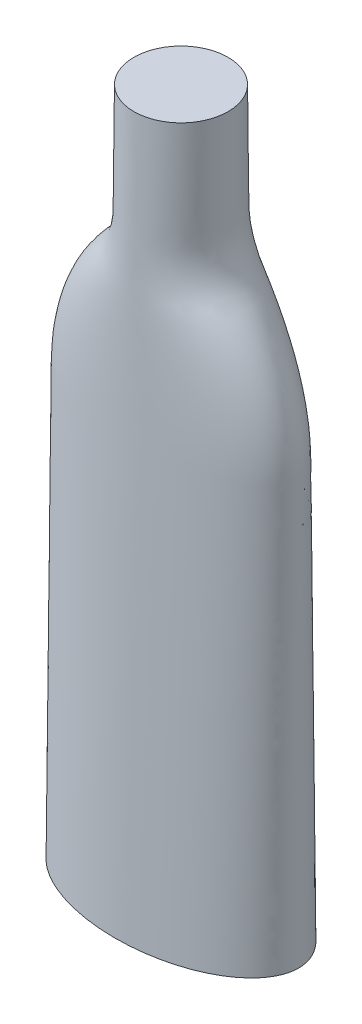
ISO-10303-21;
HEADER;
FILE_DESCRIPTION(('STEP AP214'),'2;1');
FILE_NAME('part.step','',(''),(''),'','','');
FILE_SCHEMA(('AUTOMOTIVE_DESIGN { 1 0 10303 214 1 1 1 1 }'));
ENDSEC;
DATA;
#1=APPLICATION_CONTEXT('core data for automotive mechanical design processes');
#2=APPLICATION_PROTOCOL_DEFINITION('international standard','automotive_design',2000,#1);
#3=PRODUCT_CONTEXT('',#1,'mechanical');
#4=PRODUCT('Part','Part','',(#3));
#5=PRODUCT_RELATED_PRODUCT_CATEGORY('part','',(#4));
#6=PRODUCT_DEFINITION_FORMATION('','',#4);
#7=PRODUCT_DEFINITION_CONTEXT('part definition',#1,'design');
#8=PRODUCT_DEFINITION('design','',#6,#7);
#9=PRODUCT_DEFINITION_SHAPE('','',#8);
#10=(LENGTH_UNIT() NAMED_UNIT(*) SI_UNIT(.MILLI.,.METRE.));
#11=(NAMED_UNIT(*) PLANE_ANGLE_UNIT() SI_UNIT($,.RADIAN.));
#12=(NAMED_UNIT(*) SI_UNIT($,.STERADIAN.) SOLID_ANGLE_UNIT());
#13=UNCERTAINTY_MEASURE_WITH_UNIT(LENGTH_MEASURE(1.E-05),#10,'distance_accuracy_value','');
#14=(GEOMETRIC_REPRESENTATION_CONTEXT(3) GLOBAL_UNCERTAINTY_ASSIGNED_CONTEXT((#13)) GLOBAL_UNIT_ASSIGNED_CONTEXT((#10,
#11,#12)) REPRESENTATION_CONTEXT('',''));
#15=CARTESIAN_POINT('',(0.,0.,0.));
#16=DIRECTION('',(0.,0.,1.));
#17=DIRECTION('',(1.,0.,0.));
#18=AXIS2_PLACEMENT_3D('',#15,#16,#17);
#19=CARTESIAN_POINT('',(0.,150.,0.));
#20=DIRECTION('',(0.,1.,0.));
#21=DIRECTION('',(0.,0.,1.));
#22=AXIS2_PLACEMENT_3D('',#19,#20,#21);
#23=PLANE('',#22);
#24=CARTESIAN_POINT('',(0.,150.,0.));
#25=DIRECTION('',(0.,1.,0.));
#26=DIRECTION('',(0.,0.,1.));
#27=AXIS2_PLACEMENT_3D('',#24,#25,#26);
#28=CIRCLE('',#27,10.);
#29=CARTESIAN_POINT('',(0.,150.,10.));
#30=VERTEX_POINT('',#29);
#31=EDGE_CURVE('E120',#30,#30,#28,.T.);
#32=ORIENTED_EDGE('',*,*,#31,.T.);
#33=EDGE_LOOP('',(#32));
#34=FACE_BOUND('',#33,.T.);
#35=ADVANCED_FACE('F111',(#34),#23,.T.);
#36=CARTESIAN_POINT('',(0.,0.,0.));
#37=DIRECTION('',(0.,1.,0.));
#38=DIRECTION('',(0.,0.,1.));
#39=AXIS2_PLACEMENT_3D('',#36,#37,#38);
#40=PLANE('',#39);
#41=CARTESIAN_POINT('',(0.,0.,0.));
#42=DIRECTION('',(0.,1.,0.));
#43=DIRECTION('',(1.,0.,0.));
#44=AXIS2_PLACEMENT_3D('',#41,#42,#43);
#45=ELLIPSE('',#44,25.,14.);
#46=CARTESIAN_POINT('',(25.,0.,0.));
#47=VERTEX_POINT('',#46);
#48=EDGE_CURVE('E12',#47,#47,#45,.T.);
#49=ORIENTED_EDGE('',*,*,#48,.F.);
#50=EDGE_LOOP('',(#49));
#51=FACE_BOUND('',#50,.T.);
#52=ADVANCED_FACE('F113',(#51),#40,.F.);
#53=CARTESIAN_POINT('',(25.,0.,0.));
#54=CARTESIAN_POINT('',(25.,30.,0.));
#55=CARTESIAN_POINT('',(25.,60.0000000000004,0.));
#56=CARTESIAN_POINT('',(25.,100.207742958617,0.));
#57=CARTESIAN_POINT('',(21.0969790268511,110.030130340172,0.));
#58=CARTESIAN_POINT('',(11.4636328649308,120.237873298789,0.));
#59=CARTESIAN_POINT('',(10.,123.921268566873,0.));
#60=CARTESIAN_POINT('',(10.,135.166114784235,0.));
#61=CARTESIAN_POINT('',(10.,142.583057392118,0.));
#62=CARTESIAN_POINT('',(10.,150.,0.));
#63=CARTESIAN_POINT('',(25.,0.,-0.650891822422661));
#64=CARTESIAN_POINT('',(25.,30.,-0.587990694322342));
#65=CARTESIAN_POINT('',(25.,60.0000000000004,-0.525089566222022));
#66=CARTESIAN_POINT('',(25.,100.207742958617,-0.440785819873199));
#67=CARTESIAN_POINT('',(21.0969790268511,110.030130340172,-0.419383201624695));
#68=CARTESIAN_POINT('',(11.4636328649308,120.237873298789,-0.389954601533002));
#69=CARTESIAN_POINT('',(10.,123.921268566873,-0.381928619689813));
#70=CARTESIAN_POINT('',(10.,135.166114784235,-0.358351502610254));
#71=CARTESIAN_POINT('',(10.,142.583057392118,-0.342800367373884));
#72=CARTESIAN_POINT('',(10.,150.,-0.327249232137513));
#73=CARTESIAN_POINT('',(24.8355000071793,0.,-1.95224145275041));
#74=CARTESIAN_POINT('',(24.8497661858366,30.,-1.76361666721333));
#75=CARTESIAN_POINT('',(24.8640323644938,60.0000000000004,-1.57499188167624));
#76=CARTESIAN_POINT('',(24.8831527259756,100.207742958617,-1.3221859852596));
#77=CARTESIAN_POINT('',(21.0002321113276,110.030130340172,-1.25800487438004));
#78=CARTESIAN_POINT('',(11.4111907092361,120.237873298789,-1.16975584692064));
#79=CARTESIAN_POINT('',(9.95509547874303,123.921268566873,-1.1456879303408));
#80=CARTESIAN_POINT('',(9.96044284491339,135.166114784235,-1.07498604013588));
#81=CARTESIAN_POINT('',(9.96396989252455,142.583057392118,-1.02835206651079));
#82=CARTESIAN_POINT('',(9.96749694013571,150.,-0.981718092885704));
#83=CARTESIAN_POINT('',(24.139672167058,0.,-3.78957680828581));
#84=CARTESIAN_POINT('',(24.2119885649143,30.,-3.43282983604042));
#85=CARTESIAN_POINT('',(24.2843049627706,60.0000000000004,-3.07608286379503));
#86=CARTESIAN_POINT('',(24.3812276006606,100.207742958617,-2.59794984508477));
#87=CARTESIAN_POINT('',(20.583808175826,110.030130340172,-2.47656379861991));
#88=CARTESIAN_POINT('',(11.1842063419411,120.237873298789,-2.30965798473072));
#89=CARTESIAN_POINT('',(9.76017405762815,123.921268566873,-2.26413821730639));
#90=CARTESIAN_POINT('',(9.78728028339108,135.166114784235,-2.13041938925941));
#91=CARTESIAN_POINT('',(9.80515916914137,142.583057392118,-2.04222032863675));
#92=CARTESIAN_POINT('',(9.82303805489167,150.,-1.95402126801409));
#93=CARTESIAN_POINT('',(23.0951975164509,0.,-5.44860237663));
#94=CARTESIAN_POINT('',(23.2451819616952,30.,-4.95475174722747));
#95=CARTESIAN_POINT('',(23.3951664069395,60.0000000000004,-4.46090111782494));
#96=CARTESIAN_POINT('',(23.5961842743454,100.207742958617,-3.79901381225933));
#97=CARTESIAN_POINT('',(19.9309623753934,110.030130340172,-3.63097713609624));
#98=CARTESIAN_POINT('',(10.8287578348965,120.237873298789,-3.39992670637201));
#99=CARTESIAN_POINT('',(9.4542996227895,123.921268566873,-3.33691295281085));
#100=CARTESIAN_POINT('',(9.51051802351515,135.166114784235,-3.15180380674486));
#101=CARTESIAN_POINT('',(9.54759889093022,142.583057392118,-3.02970841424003));
#102=CARTESIAN_POINT('',(9.58467975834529,150.,-2.90761302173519));
#103=CARTESIAN_POINT('',(21.7980768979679,0.,-6.91516804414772));
#104=CARTESIAN_POINT('',(22.0291751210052,30.,-6.31617272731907));
#105=CARTESIAN_POINT('',(22.2602733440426,60.0000000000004,-5.71717741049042));
#106=CARTESIAN_POINT('',(22.5700046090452,100.207742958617,-4.91436908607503));
#107=CARTESIAN_POINT('',(19.0753152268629,110.030130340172,-4.71055607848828));
#108=CARTESIAN_POINT('',(10.3638438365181,120.237873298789,-4.4303131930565));
#109=CARTESIAN_POINT('',(9.05333531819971,123.921268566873,-4.35388331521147));
#110=CARTESIAN_POINT('',(9.1399574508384,135.166114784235,-4.12936297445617));
#111=CARTESIAN_POINT('',(9.19709219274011,142.583057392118,-3.98127251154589));
#112=CARTESIAN_POINT('',(9.25422693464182,150.,-3.83318204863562));
#113=CARTESIAN_POINT('',(20.3219609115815,0.,-8.19851120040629));
#114=CARTESIAN_POINT('',(20.6257903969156,30.,-7.52272515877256));
#115=CARTESIAN_POINT('',(20.9296198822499,60.0000000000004,-6.84693911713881));
#116=CARTESIAN_POINT('',(21.3368298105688,100.207742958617,-5.94121140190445));
#117=CARTESIAN_POINT('',(18.0441246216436,110.030130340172,-5.71126972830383));
#118=CARTESIAN_POINT('',(9.80413266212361,120.237873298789,-5.39509992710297));
#119=CARTESIAN_POINT('',(8.56936821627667,123.921268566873,-5.30887179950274));
#120=CARTESIAN_POINT('',(8.6832520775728,135.166114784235,-5.05556812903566));
#121=CARTESIAN_POINT('',(8.75836827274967,142.583057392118,-4.88849258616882));
#122=CARTESIAN_POINT('',(8.83348446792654,150.,-4.72141704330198));
#123=CARTESIAN_POINT('',(18.7173385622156,0.,-9.31544330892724));
#124=CARTESIAN_POINT('',(19.0788740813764,30.,-8.58641222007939));
#125=CARTESIAN_POINT('',(19.4404096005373,60.0000000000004,-7.85738113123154));
#126=CARTESIAN_POINT('',(19.9249605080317,100.207742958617,-6.88029131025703));
#127=CARTESIAN_POINT('',(16.8605722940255,110.030130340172,-6.63223257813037));
#128=CARTESIAN_POINT('',(9.16264254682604,120.237873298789,-6.29115182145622));
#129=CARTESIAN_POINT('',(8.01349696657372,123.921268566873,-6.19812979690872));
#130=CARTESIAN_POINT('',(8.14901067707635,135.166114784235,-5.92486838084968));
#131=CARTESIAN_POINT('',(8.23839361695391,142.583057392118,-5.74462898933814));
#132=CARTESIAN_POINT('',(8.32777655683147,150.,-5.5643895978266));
#133=CARTESIAN_POINT('',(17.0196205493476,0.,-10.2832913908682));
#134=CARTESIAN_POINT('',(17.4201246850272,30.,-9.5196524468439));
#135=CARTESIAN_POINT('',(17.820628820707,60.0000000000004,-8.75601350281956));
#136=CARTESIAN_POINT('',(18.3574077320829,100.207742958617,-7.73254022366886));
#137=CARTESIAN_POINT('',(15.5435475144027,110.030130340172,-7.47270588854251));
#138=CARTESIAN_POINT('',(8.44947032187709,120.237873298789,-7.11543367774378));
#139=CARTESIAN_POINT('',(7.39427274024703,123.921268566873,-7.0179958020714));
#140=CARTESIAN_POINT('',(7.54439298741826,135.166114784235,-6.73176238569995));
#141=CARTESIAN_POINT('',(7.64341019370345,142.583057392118,-6.54296684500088));
#142=CARTESIAN_POINT('',(7.74242739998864,150.,-6.3541713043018));
#143=CARTESIAN_POINT('',(14.6628204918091,0.,-11.3943398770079));
#144=CARTESIAN_POINT('',(15.0885107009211,30.,-10.6035888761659));
#145=CARTESIAN_POINT('',(15.5142009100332,60.0000000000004,-9.81283787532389));
#146=CARTESIAN_POINT('',(16.0847356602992,100.207742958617,-8.75302744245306));
#147=CARTESIAN_POINT('',(13.6301072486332,110.030130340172,-8.48396801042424));
#148=CARTESIAN_POINT('',(7.41330942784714,120.237873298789,-8.11401129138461));
#149=CARTESIAN_POINT('',(6.49282377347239,123.921268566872,-8.0131140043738));
#150=CARTESIAN_POINT('',(6.65238447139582,135.166114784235,-7.71671822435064));
#151=CARTESIAN_POINT('',(6.75762846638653,142.583057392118,-7.52121973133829));
#152=CARTESIAN_POINT('',(6.86287246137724,150.,-7.32572123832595));
#153=CARTESIAN_POINT('',(11.5883361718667,0.,-12.4797834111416));
#154=CARTESIAN_POINT('',(11.9942531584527,30.,-11.6805536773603));
#155=CARTESIAN_POINT('',(12.400170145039,60.0000000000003,-10.8813239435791));
#156=CARTESIAN_POINT('',(12.9442036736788,100.207742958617,-9.81014982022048));
#157=CARTESIAN_POINT('',(10.9783479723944,110.030130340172,-9.53820543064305));
#158=CARTESIAN_POINT('',(5.97528255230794,120.237873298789,-9.16428189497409));
#159=CARTESIAN_POINT('',(5.23808666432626,123.921268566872,-9.06230274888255));
#160=CARTESIAN_POINT('',(5.39023580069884,135.166114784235,-8.76272890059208));
#161=CARTESIAN_POINT('',(5.4905912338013,142.583057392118,-8.56513419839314));
#162=CARTESIAN_POINT('',(5.59094666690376,150.,-8.3675394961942));
#163=CARTESIAN_POINT('',(7.78040936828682,0.,-13.3685958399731));
#164=CARTESIAN_POINT('',(8.09304532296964,30.,-12.577701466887));
#165=CARTESIAN_POINT('',(8.40568127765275,60.0000000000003,-11.7868070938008));
#166=CARTESIAN_POINT('',(8.82469414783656,100.207742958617,-10.7268045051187));
#167=CARTESIAN_POINT('',(7.49030746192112,110.030130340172,-10.4576962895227));
#168=CARTESIAN_POINT('',(4.08051629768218,120.237873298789,-10.0876724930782));
#169=CARTESIAN_POINT('',(3.58012129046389,123.921268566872,-9.98675691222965));
#170=CARTESIAN_POINT('',(3.69730606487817,135.166114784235,-9.69030739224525));
#171=CARTESIAN_POINT('',(3.77459949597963,142.583057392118,-9.49477345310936));
#172=CARTESIAN_POINT('',(3.85189292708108,150.,-9.29923951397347));
#173=CARTESIAN_POINT('',(3.90534649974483,0.,-13.8864871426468));
#174=CARTESIAN_POINT('',(4.0745272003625,30.,-13.1059004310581));
#175=CARTESIAN_POINT('',(4.2437079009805,60.0000000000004,-12.3253137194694));
#176=CARTESIAN_POINT('',(4.47045370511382,100.207742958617,-11.2791260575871));
#177=CARTESIAN_POINT('',(3.79620237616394,110.030130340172,-11.0135251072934));
#178=CARTESIAN_POINT('',(2.0691019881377,120.237873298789,-10.6483238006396));
#179=CARTESIAN_POINT('',(1.81625773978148,123.921268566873,-10.5487234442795));
#180=CARTESIAN_POINT('',(1.87967143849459,135.166114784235,-10.2561375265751));
#181=CARTESIAN_POINT('',(1.92149822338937,142.583057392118,-10.0631519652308));
#182=CARTESIAN_POINT('',(1.96332500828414,150.,-9.87016640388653));
#183=CARTESIAN_POINT('',(0.,0.,-14.0567323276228));
#184=CARTESIAN_POINT('',(-1.08126451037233E-13,30.,-13.2810093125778));
#185=CARTESIAN_POINT('',(1.11392994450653E-13,60.0000000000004,-12.5052862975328));
#186=CARTESIAN_POINT('',(0.,100.207742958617,-11.4656172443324));
#187=CARTESIAN_POINT('',(1.24373716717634E-13,110.030130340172,-11.201671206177));
#188=CARTESIAN_POINT('',(0.,120.237873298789,-10.8387454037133));
#189=CARTESIAN_POINT('',(0.,123.921268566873,-10.739765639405));
#190=CARTESIAN_POINT('',(0.,135.166114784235,-10.4490027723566));
#191=CARTESIAN_POINT('',(0.,142.583057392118,-10.2572196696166));
#192=CARTESIAN_POINT('',(0.,150.,-10.0654365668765));
#193=CARTESIAN_POINT('',(-3.90534649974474,0.,-13.8864871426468));
#194=CARTESIAN_POINT('',(-4.07452720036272,30.,-13.1059004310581));
#195=CARTESIAN_POINT('',(-4.24370790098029,60.0000000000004,-12.3253137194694));
#196=CARTESIAN_POINT('',(-4.47045370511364,100.207742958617,-11.2791260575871));
#197=CARTESIAN_POINT('',(-3.7962023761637,110.030130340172,-11.0135251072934));
#198=CARTESIAN_POINT('',(-2.06910198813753,120.237873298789,-10.6483238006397));
#199=CARTESIAN_POINT('',(-1.81625773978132,123.921268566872,-10.5487234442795));
#200=CARTESIAN_POINT('',(-1.87967143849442,135.166114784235,-10.2561375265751));
#201=CARTESIAN_POINT('',(-1.92149822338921,142.583057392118,-10.0631519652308));
#202=CARTESIAN_POINT('',(-1.96332500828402,150.,-9.87016640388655));
#203=CARTESIAN_POINT('',(-7.78040936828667,0.,-13.3685958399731));
#204=CARTESIAN_POINT('',(-8.09304532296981,30.,-12.577701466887));
#205=CARTESIAN_POINT('',(-8.40568127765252,60.0000000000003,-11.7868070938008));
#206=CARTESIAN_POINT('',(-8.82469414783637,100.207742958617,-10.7268045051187));
#207=CARTESIAN_POINT('',(-7.49030746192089,110.030130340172,-10.4576962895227));
#208=CARTESIAN_POINT('',(-4.08051629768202,120.237873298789,-10.0876724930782));
#209=CARTESIAN_POINT('',(-3.58012129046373,123.921268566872,-9.98675691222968));
#210=CARTESIAN_POINT('',(-3.69730606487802,135.166114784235,-9.69030739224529));
#211=CARTESIAN_POINT('',(-3.77459949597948,142.583057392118,-9.4947734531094));
#212=CARTESIAN_POINT('',(-3.85189292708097,150.,-9.29923951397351));
#213=CARTESIAN_POINT('',(-11.5883361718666,0.,-12.4797834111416));
#214=CARTESIAN_POINT('',(-11.9942531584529,30.,-11.6805536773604));
#215=CARTESIAN_POINT('',(-12.4001701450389,60.0000000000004,-10.8813239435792));
#216=CARTESIAN_POINT('',(-12.9442036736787,100.207742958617,-9.81014982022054));
#217=CARTESIAN_POINT('',(-10.9783479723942,110.030130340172,-9.53820543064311));
#218=CARTESIAN_POINT('',(-5.9752825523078,120.237873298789,-9.16428189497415));
#219=CARTESIAN_POINT('',(-5.23808666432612,123.921268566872,-9.06230274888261));
#220=CARTESIAN_POINT('',(-5.3902358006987,135.166114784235,-8.76272890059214));
#221=CARTESIAN_POINT('',(-5.49059123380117,142.583057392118,-8.56513419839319));
#222=CARTESIAN_POINT('',(-5.59094666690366,150.,-8.36753949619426));
#223=CARTESIAN_POINT('',(-14.6628204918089,0.,-11.3943398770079));
#224=CARTESIAN_POINT('',(-15.0885107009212,30.,-10.6035888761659));
#225=CARTESIAN_POINT('',(-15.514200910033,60.0000000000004,-9.81283787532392));
#226=CARTESIAN_POINT('',(-16.0847356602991,100.207742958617,-8.7530274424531));
#227=CARTESIAN_POINT('',(-13.630107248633,110.030130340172,-8.48396801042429));
#228=CARTESIAN_POINT('',(-7.41330942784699,120.237873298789,-8.11401129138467));
#229=CARTESIAN_POINT('',(-6.49282377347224,123.921268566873,-8.01311400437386));
#230=CARTESIAN_POINT('',(-6.65238447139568,135.166114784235,-7.71671822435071));
#231=CARTESIAN_POINT('',(-6.7576284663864,142.583057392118,-7.52121973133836));
#232=CARTESIAN_POINT('',(-6.86287246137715,150.,-7.32572123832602));
#233=CARTESIAN_POINT('',(-17.0196205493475,0.,-10.2832913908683));
#234=CARTESIAN_POINT('',(-17.4201246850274,30.,-9.51965244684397));
#235=CARTESIAN_POINT('',(-17.8206288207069,60.0000000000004,-8.75601350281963));
#236=CARTESIAN_POINT('',(-18.3574077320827,100.207742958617,-7.73254022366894));
#237=CARTESIAN_POINT('',(-15.5435475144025,110.030130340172,-7.4727058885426));
#238=CARTESIAN_POINT('',(-8.44947032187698,120.237873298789,-7.11543367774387));
#239=CARTESIAN_POINT('',(-7.39427274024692,123.921268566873,-7.01799580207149));
#240=CARTESIAN_POINT('',(-7.54439298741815,135.166114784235,-6.73176238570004));
#241=CARTESIAN_POINT('',(-7.64341019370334,142.583057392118,-6.54296684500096));
#242=CARTESIAN_POINT('',(-7.74242739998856,150.,-6.35417130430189));
#243=CARTESIAN_POINT('',(-18.7173385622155,0.,-9.31544330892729));
#244=CARTESIAN_POINT('',(-19.0788740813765,30.,-8.58641222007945));
#245=CARTESIAN_POINT('',(-19.4404096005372,60.0000000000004,-7.85738113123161));
#246=CARTESIAN_POINT('',(-19.9249605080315,100.207742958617,-6.88029131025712));
#247=CARTESIAN_POINT('',(-16.8605722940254,110.030130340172,-6.63223257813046));
#248=CARTESIAN_POINT('',(-9.16264254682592,120.237873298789,-6.29115182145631));
#249=CARTESIAN_POINT('',(-8.01349696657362,123.921268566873,-6.19812979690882));
#250=CARTESIAN_POINT('',(-8.14901067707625,135.166114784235,-5.92486838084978));
#251=CARTESIAN_POINT('',(-8.23839361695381,142.583057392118,-5.74462898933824));
#252=CARTESIAN_POINT('',(-8.3277765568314,150.,-5.56438959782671));
#253=CARTESIAN_POINT('',(-20.3219609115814,0.,-8.19851120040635));
#254=CARTESIAN_POINT('',(-20.6257903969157,30.,-7.52272515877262));
#255=CARTESIAN_POINT('',(-20.9296198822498,60.0000000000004,-6.84693911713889));
#256=CARTESIAN_POINT('',(-21.3368298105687,100.207742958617,-5.94121140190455));
#257=CARTESIAN_POINT('',(-18.0441246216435,110.030130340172,-5.71126972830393));
#258=CARTESIAN_POINT('',(-9.80413266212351,120.237873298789,-5.39509992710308));
#259=CARTESIAN_POINT('',(-8.56936821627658,123.921268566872,-5.30887179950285));
#260=CARTESIAN_POINT('',(-8.68325207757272,135.166114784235,-5.05556812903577));
#261=CARTESIAN_POINT('',(-8.75836827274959,142.583057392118,-4.88849258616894));
#262=CARTESIAN_POINT('',(-8.83348446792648,150.,-4.7214170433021));
#263=CARTESIAN_POINT('',(-21.7980768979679,0.,-6.9151680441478));
#264=CARTESIAN_POINT('',(-22.0291751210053,30.,-6.31617272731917));
#265=CARTESIAN_POINT('',(-22.2602733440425,60.0000000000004,-5.71717741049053));
#266=CARTESIAN_POINT('',(-22.5700046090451,100.207742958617,-4.91436908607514));
#267=CARTESIAN_POINT('',(-19.0753152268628,110.030130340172,-4.7105560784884));
#268=CARTESIAN_POINT('',(-10.363843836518,120.237873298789,-4.43031319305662));
#269=CARTESIAN_POINT('',(-9.05333531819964,123.921268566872,-4.35388331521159));
#270=CARTESIAN_POINT('',(-9.13995745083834,135.166114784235,-4.12936297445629));
#271=CARTESIAN_POINT('',(-9.19709219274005,142.583057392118,-3.98127251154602));
#272=CARTESIAN_POINT('',(-9.25422693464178,150.,-3.83318204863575));
#273=CARTESIAN_POINT('',(-23.0951975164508,0.,-5.44860237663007));
#274=CARTESIAN_POINT('',(-23.2451819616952,30.,-4.95475174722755));
#275=CARTESIAN_POINT('',(-23.3951664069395,60.0000000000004,-4.46090111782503));
#276=CARTESIAN_POINT('',(-23.5961842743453,100.207742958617,-3.79901381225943));
#277=CARTESIAN_POINT('',(-19.9309623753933,110.030130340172,-3.63097713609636));
#278=CARTESIAN_POINT('',(-10.8287578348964,120.237873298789,-3.39992670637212));
#279=CARTESIAN_POINT('',(-9.45429962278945,123.921268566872,-3.33691295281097));
#280=CARTESIAN_POINT('',(-9.5105180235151,135.166114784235,-3.15180380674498));
#281=CARTESIAN_POINT('',(-9.54759889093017,142.583057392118,-3.02970841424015));
#282=CARTESIAN_POINT('',(-9.58467975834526,150.,-2.90761302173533));
#283=CARTESIAN_POINT('',(-24.139672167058,0.,-3.7895768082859));
#284=CARTESIAN_POINT('',(-24.2119885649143,30.,-3.43282983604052));
#285=CARTESIAN_POINT('',(-24.2843049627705,60.0000000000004,-3.07608286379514));
#286=CARTESIAN_POINT('',(-24.3812276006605,100.207742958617,-2.59794984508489));
#287=CARTESIAN_POINT('',(-20.5838081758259,110.030130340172,-2.47656379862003));
#288=CARTESIAN_POINT('',(-11.1842063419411,120.237873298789,-2.30965798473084));
#289=CARTESIAN_POINT('',(-9.76017405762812,123.921268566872,-2.26413821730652));
#290=CARTESIAN_POINT('',(-9.78728028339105,135.166114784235,-2.13041938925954));
#291=CARTESIAN_POINT('',(-9.80515916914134,142.583057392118,-2.04222032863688));
#292=CARTESIAN_POINT('',(-9.82303805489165,150.,-1.95402126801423));
#293=CARTESIAN_POINT('',(-24.8355000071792,0.,-1.95224145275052));
#294=CARTESIAN_POINT('',(-24.8497661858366,30.,-1.76361666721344));
#295=CARTESIAN_POINT('',(-24.8640323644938,60.0000000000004,-1.57499188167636));
#296=CARTESIAN_POINT('',(-24.8831527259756,100.207742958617,-1.32218598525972));
#297=CARTESIAN_POINT('',(-21.0002321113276,110.030130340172,-1.25800487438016));
#298=CARTESIAN_POINT('',(-11.411190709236,120.237873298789,-1.16975584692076));
#299=CARTESIAN_POINT('',(-9.95509547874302,123.921268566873,-1.14568793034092));
#300=CARTESIAN_POINT('',(-9.96044284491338,135.166114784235,-1.074986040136));
#301=CARTESIAN_POINT('',(-9.96396989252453,142.583057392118,-1.02835206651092));
#302=CARTESIAN_POINT('',(-9.9674969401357,150.,-0.981718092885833));
#303=CARTESIAN_POINT('',(-25.,0.,-0.650891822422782));
#304=CARTESIAN_POINT('',(-25.,30.,-0.587990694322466));
#305=CARTESIAN_POINT('',(-25.,60.0000000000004,-0.525089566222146));
#306=CARTESIAN_POINT('',(-25.,100.207742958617,-0.440785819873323));
#307=CARTESIAN_POINT('',(-21.0969790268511,110.030130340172,-0.419383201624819));
#308=CARTESIAN_POINT('',(-11.4636328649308,120.237873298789,-0.389954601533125));
#309=CARTESIAN_POINT('',(-10.,123.921268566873,-0.381928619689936));
#310=CARTESIAN_POINT('',(-10.,135.166114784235,-0.358351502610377));
#311=CARTESIAN_POINT('',(-9.99999999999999,142.583057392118,-0.342800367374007));
#312=CARTESIAN_POINT('',(-9.99999999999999,150.,-0.327249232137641));
#313=CARTESIAN_POINT('',(-25.,0.,0.65089182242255));
#314=CARTESIAN_POINT('',(-25.,30.,0.587990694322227));
#315=CARTESIAN_POINT('',(-25.0000000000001,60.0000000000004,0.525089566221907));
#316=CARTESIAN_POINT('',(-25.,100.207742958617,0.440785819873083));
#317=CARTESIAN_POINT('',(-21.0969790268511,110.030130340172,0.419383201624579));
#318=CARTESIAN_POINT('',(-11.4636328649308,120.237873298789,0.389954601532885));
#319=CARTESIAN_POINT('',(-10.,123.921268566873,0.381928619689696));
#320=CARTESIAN_POINT('',(-10.,135.166114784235,0.358351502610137));
#321=CARTESIAN_POINT('',(-10.,142.583057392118,0.342800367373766));
#322=CARTESIAN_POINT('',(-10.,150.,0.327249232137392));
#323=CARTESIAN_POINT('',(-24.8355000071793,0.,1.95224145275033));
#324=CARTESIAN_POINT('',(-24.8497661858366,30.,1.76361666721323));
#325=CARTESIAN_POINT('',(-24.8640323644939,60.0000000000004,1.57499188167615));
#326=CARTESIAN_POINT('',(-24.8831527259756,100.207742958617,1.32218598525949));
#327=CARTESIAN_POINT('',(-21.0002321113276,110.030130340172,1.25800487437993));
#328=CARTESIAN_POINT('',(-11.4111907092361,120.237873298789,1.16975584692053));
#329=CARTESIAN_POINT('',(-9.95509547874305,123.921268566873,1.14568793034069));
#330=CARTESIAN_POINT('',(-9.96044284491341,135.166114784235,1.07498604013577));
#331=CARTESIAN_POINT('',(-9.96396989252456,142.583057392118,1.02835206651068));
#332=CARTESIAN_POINT('',(-9.96749694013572,150.,0.981718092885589));
#333=CARTESIAN_POINT('',(-24.139672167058,0.,3.78957680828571));
#334=CARTESIAN_POINT('',(-24.2119885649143,30.,3.43282983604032));
#335=CARTESIAN_POINT('',(-24.2843049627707,60.0000000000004,3.07608286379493));
#336=CARTESIAN_POINT('',(-24.3812276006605,100.207742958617,2.59794984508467));
#337=CARTESIAN_POINT('',(-20.583808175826,110.030130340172,2.4765637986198));
#338=CARTESIAN_POINT('',(-11.1842063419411,120.237873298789,2.30965798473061));
#339=CARTESIAN_POINT('',(-9.76017405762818,123.921268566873,2.26413821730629));
#340=CARTESIAN_POINT('',(-9.78728028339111,135.166114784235,2.13041938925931));
#341=CARTESIAN_POINT('',(-9.8051591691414,142.583057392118,2.04222032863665));
#342=CARTESIAN_POINT('',(-9.82303805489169,150.,1.95402126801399));
#343=CARTESIAN_POINT('',(-23.0951975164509,0.,5.44860237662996));
#344=CARTESIAN_POINT('',(-23.2451819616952,30.,4.95475174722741));
#345=CARTESIAN_POINT('',(-23.3951664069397,60.0000000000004,4.46090111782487));
#346=CARTESIAN_POINT('',(-23.5961842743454,100.207742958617,3.79901381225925));
#347=CARTESIAN_POINT('',(-19.9309623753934,110.030130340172,3.63097713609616));
#348=CARTESIAN_POINT('',(-10.8287578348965,120.237873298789,3.39992670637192));
#349=CARTESIAN_POINT('',(-9.45429962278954,123.921268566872,3.33691295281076));
#350=CARTESIAN_POINT('',(-9.51051802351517,135.166114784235,3.15180380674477));
#351=CARTESIAN_POINT('',(-9.54759889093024,142.583057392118,3.02970841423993));
#352=CARTESIAN_POINT('',(-9.58467975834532,150.,2.90761302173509));
#353=CARTESIAN_POINT('',(-21.7980768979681,0.,6.91516804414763));
#354=CARTESIAN_POINT('',(-22.0291751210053,30.,6.31617272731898));
#355=CARTESIAN_POINT('',(-22.2602733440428,60.0000000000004,5.71717741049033));
#356=CARTESIAN_POINT('',(-22.5700046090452,100.207742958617,4.91436908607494));
#357=CARTESIAN_POINT('',(-19.075315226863,110.030130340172,4.71055607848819));
#358=CARTESIAN_POINT('',(-10.3638438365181,120.237873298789,4.43031319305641));
#359=CARTESIAN_POINT('',(-9.05333531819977,123.921268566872,4.35388331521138));
#360=CARTESIAN_POINT('',(-9.13995745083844,135.166114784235,4.12936297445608));
#361=CARTESIAN_POINT('',(-9.19709219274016,142.583057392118,3.9812725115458));
#362=CARTESIAN_POINT('',(-9.25422693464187,150.,3.83318204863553));
#363=CARTESIAN_POINT('',(-20.3219609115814,0.,8.19851120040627));
#364=CARTESIAN_POINT('',(-20.6257903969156,30.,7.52272515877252));
#365=CARTESIAN_POINT('',(-20.92961988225,60.0000000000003,6.84693911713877));
#366=CARTESIAN_POINT('',(-21.3368298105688,100.207742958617,5.94121140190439));
#367=CARTESIAN_POINT('',(-18.0441246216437,110.030130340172,5.71126972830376));
#368=CARTESIAN_POINT('',(-9.80413266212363,120.237873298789,5.3950999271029));
#369=CARTESIAN_POINT('',(-8.56936821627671,123.921268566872,5.30887179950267));
#370=CARTESIAN_POINT('',(-8.68325207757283,135.166114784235,5.05556812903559));
#371=CARTESIAN_POINT('',(-8.75836827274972,142.583057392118,4.88849258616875));
#372=CARTESIAN_POINT('',(-8.83348446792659,150.,4.7214170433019));
#373=CARTESIAN_POINT('',(-18.7173385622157,0.,9.3154433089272));
#374=CARTESIAN_POINT('',(-19.0788740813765,30.,8.58641222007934));
#375=CARTESIAN_POINT('',(-19.4404096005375,60.0000000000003,7.85738113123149));
#376=CARTESIAN_POINT('',(-19.9249605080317,100.207742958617,6.88029131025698));
#377=CARTESIAN_POINT('',(-16.8605722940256,110.030130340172,6.63223257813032));
#378=CARTESIAN_POINT('',(-9.16264254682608,120.237873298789,6.29115182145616));
#379=CARTESIAN_POINT('',(-8.01349696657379,123.921268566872,6.19812979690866));
#380=CARTESIAN_POINT('',(-8.14901067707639,135.166114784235,5.92486838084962));
#381=CARTESIAN_POINT('',(-8.23839361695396,142.583057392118,5.74462898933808));
#382=CARTESIAN_POINT('',(-8.32777655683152,150.,5.56438959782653));
#383=CARTESIAN_POINT('',(-17.0196205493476,0.,10.2832913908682));
#384=CARTESIAN_POINT('',(-17.4201246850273,30.,9.51965244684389));
#385=CARTESIAN_POINT('',(-17.8206288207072,60.0000000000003,8.75601350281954));
#386=CARTESIAN_POINT('',(-18.3574077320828,100.207742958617,7.73254022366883));
#387=CARTESIAN_POINT('',(-15.5435475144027,110.030130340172,7.47270588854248));
#388=CARTESIAN_POINT('',(-8.44947032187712,120.237873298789,7.11543367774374));
#389=CARTESIAN_POINT('',(-7.39427274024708,123.921268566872,7.01799580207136));
#390=CARTESIAN_POINT('',(-7.54439298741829,135.166114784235,6.7317623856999));
#391=CARTESIAN_POINT('',(-7.6434101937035,142.583057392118,6.54296684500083));
#392=CARTESIAN_POINT('',(-7.7424273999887,150.,6.35417130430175));
#393=CARTESIAN_POINT('',(-14.6628204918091,0.,11.3943398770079));
#394=CARTESIAN_POINT('',(-15.0885107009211,30.,10.6035888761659));
#395=CARTESIAN_POINT('',(-15.5142009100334,60.0000000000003,9.81283787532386));
#396=CARTESIAN_POINT('',(-16.0847356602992,100.207742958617,8.75302744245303));
#397=CARTESIAN_POINT('',(-13.6301072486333,110.030130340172,8.48396801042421));
#398=CARTESIAN_POINT('',(-7.41330942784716,120.237873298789,8.11401129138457));
#399=CARTESIAN_POINT('',(-6.49282377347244,123.921268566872,8.01311400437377));
#400=CARTESIAN_POINT('',(-6.65238447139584,135.166114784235,7.71671822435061));
#401=CARTESIAN_POINT('',(-6.75762846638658,142.583057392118,7.52121973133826));
#402=CARTESIAN_POINT('',(-6.8628724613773,150.,7.32572123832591));
#403=CARTESIAN_POINT('',(-11.5883361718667,0.,12.4797834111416));
#404=CARTESIAN_POINT('',(-11.9942531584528,30.,11.6805536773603));
#405=CARTESIAN_POINT('',(-12.4001701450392,60.0000000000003,10.8813239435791));
#406=CARTESIAN_POINT('',(-12.9442036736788,100.207742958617,9.81014982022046));
#407=CARTESIAN_POINT('',(-10.9783479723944,110.030130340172,9.53820543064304));
#408=CARTESIAN_POINT('',(-5.97528255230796,120.237873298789,9.16428189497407));
#409=CARTESIAN_POINT('',(-5.2380866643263,123.921268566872,9.06230274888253));
#410=CARTESIAN_POINT('',(-5.39023580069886,135.166114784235,8.76272890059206));
#411=CARTESIAN_POINT('',(-5.49059123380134,142.583057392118,8.56513419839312));
#412=CARTESIAN_POINT('',(-5.59094666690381,150.,8.36753949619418));
#413=CARTESIAN_POINT('',(-7.78040936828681,0.,13.3685958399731));
#414=CARTESIAN_POINT('',(-8.09304532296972,30.,12.577701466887));
#415=CARTESIAN_POINT('',(-8.40568127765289,60.0000000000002,11.7868070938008));
#416=CARTESIAN_POINT('',(-8.8246941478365,100.207742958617,10.7268045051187));
#417=CARTESIAN_POINT('',(-7.49030746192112,110.030130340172,10.4576962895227));
#418=CARTESIAN_POINT('',(-4.08051629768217,120.237873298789,10.0876724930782));
#419=CARTESIAN_POINT('',(-3.58012129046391,123.921268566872,9.98675691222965));
#420=CARTESIAN_POINT('',(-3.69730606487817,135.166114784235,9.69030739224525));
#421=CARTESIAN_POINT('',(-3.77459949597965,142.583057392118,9.49477345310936));
#422=CARTESIAN_POINT('',(-3.85189292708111,150.,9.29923951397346));
#423=CARTESIAN_POINT('',(-3.90534649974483,0.,13.8864871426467));
#424=CARTESIAN_POINT('',(-4.0745272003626,29.9999999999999,13.1059004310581));
#425=CARTESIAN_POINT('',(-4.24370790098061,60.0000000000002,12.3253137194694));
#426=CARTESIAN_POINT('',(-4.47045370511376,100.207742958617,11.279126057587));
#427=CARTESIAN_POINT('',(-3.79620237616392,110.030130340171,11.0135251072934));
#428=CARTESIAN_POINT('',(-2.06910198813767,120.237873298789,10.6483238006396));
#429=CARTESIAN_POINT('',(-1.81625773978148,123.921268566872,10.5487234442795));
#430=CARTESIAN_POINT('',(-1.87967143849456,135.166114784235,10.2561375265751));
#431=CARTESIAN_POINT('',(-1.92149822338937,142.583057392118,10.0631519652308));
#432=CARTESIAN_POINT('',(-1.96332500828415,150.,9.87016640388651));
#433=CARTESIAN_POINT('',(0.,0.,14.0567323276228));
#434=CARTESIAN_POINT('',(0.,30.,13.2810093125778));
#435=CARTESIAN_POINT('',(-1.79888313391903E-13,60.0000000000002,12.5052862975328));
#436=CARTESIAN_POINT('',(0.,100.207742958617,11.4656172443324));
#437=CARTESIAN_POINT('',(0.,110.030130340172,11.201671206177));
#438=CARTESIAN_POINT('',(0.,120.237873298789,10.8387454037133));
#439=CARTESIAN_POINT('',(0.,123.921268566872,10.739765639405));
#440=CARTESIAN_POINT('',(0.,135.166114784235,10.4490027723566));
#441=CARTESIAN_POINT('',(0.,142.583057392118,10.2572196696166));
#442=CARTESIAN_POINT('',(0.,150.,10.0654365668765));
#443=CARTESIAN_POINT('',(3.90534649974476,0.,13.8864871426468));
#444=CARTESIAN_POINT('',(4.07452720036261,30.,13.1059004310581));
#445=CARTESIAN_POINT('',(4.24370790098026,60.0000000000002,12.3253137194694));
#446=CARTESIAN_POINT('',(4.47045370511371,100.207742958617,11.2791260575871));
#447=CARTESIAN_POINT('',(3.79620237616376,110.030130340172,11.0135251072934));
#448=CARTESIAN_POINT('',(2.06910198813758,120.237873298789,10.6483238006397));
#449=CARTESIAN_POINT('',(1.81625773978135,123.921268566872,10.5487234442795));
#450=CARTESIAN_POINT('',(1.87967143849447,135.166114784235,10.2561375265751));
#451=CARTESIAN_POINT('',(1.92149822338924,142.583057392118,10.0631519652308));
#452=CARTESIAN_POINT('',(1.96332500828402,150.,9.87016640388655));
#453=CARTESIAN_POINT('',(7.78040936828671,0.,13.3685958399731));
#454=CARTESIAN_POINT('',(8.0930453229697,30.,12.577701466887));
#455=CARTESIAN_POINT('',(8.40568127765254,60.0000000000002,11.7868070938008));
#456=CARTESIAN_POINT('',(8.82469414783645,100.207742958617,10.7268045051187));
#457=CARTESIAN_POINT('',(7.49030746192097,110.030130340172,10.4576962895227));
#458=CARTESIAN_POINT('',(4.08051629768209,120.237873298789,10.0876724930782));
#459=CARTESIAN_POINT('',(3.58012129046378,123.921268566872,9.98675691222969));
#460=CARTESIAN_POINT('',(3.69730606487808,135.166114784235,9.6903073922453));
#461=CARTESIAN_POINT('',(3.77459949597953,142.583057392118,9.49477345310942));
#462=CARTESIAN_POINT('',(3.85189292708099,150.,9.29923951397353));
#463=CARTESIAN_POINT('',(11.5883361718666,0.,12.4797834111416));
#464=CARTESIAN_POINT('',(11.9942531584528,30.,11.6805536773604));
#465=CARTESIAN_POINT('',(12.4001701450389,60.0000000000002,10.8813239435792));
#466=CARTESIAN_POINT('',(12.9442036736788,100.207742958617,9.81014982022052));
#467=CARTESIAN_POINT('',(10.9783479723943,110.030130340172,9.53820543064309));
#468=CARTESIAN_POINT('',(5.97528255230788,120.237873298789,9.16428189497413));
#469=CARTESIAN_POINT('',(5.23808666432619,123.921268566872,9.06230274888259));
#470=CARTESIAN_POINT('',(5.39023580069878,135.166114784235,8.76272890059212));
#471=CARTESIAN_POINT('',(5.49059123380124,142.583057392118,8.56513419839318));
#472=CARTESIAN_POINT('',(5.59094666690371,150.,8.36753949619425));
#473=CARTESIAN_POINT('',(14.662820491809,0.,11.3943398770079));
#474=CARTESIAN_POINT('',(15.0885107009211,30.,10.6035888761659));
#475=CARTESIAN_POINT('',(15.5142009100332,60.0000000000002,9.8128378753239));
#476=CARTESIAN_POINT('',(16.0847356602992,100.207742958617,8.75302744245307));
#477=CARTESIAN_POINT('',(13.6301072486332,110.030130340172,8.48396801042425));
#478=CARTESIAN_POINT('',(7.4133094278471,120.237873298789,8.11401129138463));
#479=CARTESIAN_POINT('',(6.49282377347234,123.921268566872,8.01311400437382));
#480=CARTESIAN_POINT('',(6.65238447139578,135.166114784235,7.71671822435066));
#481=CARTESIAN_POINT('',(6.75762846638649,142.583057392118,7.52121973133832));
#482=CARTESIAN_POINT('',(6.86287246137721,150.,7.32572123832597));
#483=CARTESIAN_POINT('',(17.0196205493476,0.,10.2832913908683));
#484=CARTESIAN_POINT('',(17.4201246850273,30.,9.51965244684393));
#485=CARTESIAN_POINT('',(17.820628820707,60.0000000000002,8.75601350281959));
#486=CARTESIAN_POINT('',(18.3574077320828,100.207742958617,7.73254022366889));
#487=CARTESIAN_POINT('',(15.5435475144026,110.030130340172,7.47270588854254));
#488=CARTESIAN_POINT('',(8.44947032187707,120.237873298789,7.11543367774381));
#489=CARTESIAN_POINT('',(7.394272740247,123.921268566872,7.01799580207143));
#490=CARTESIAN_POINT('',(7.54439298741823,135.166114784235,6.73176238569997));
#491=CARTESIAN_POINT('',(7.64341019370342,142.583057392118,6.5429668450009));
#492=CARTESIAN_POINT('',(7.74242739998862,150.,6.35417130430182));
#493=CARTESIAN_POINT('',(18.7173385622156,0.,9.31544330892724));
#494=CARTESIAN_POINT('',(19.0788740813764,30.,8.5864122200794));
#495=CARTESIAN_POINT('',(19.4404096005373,60.0000000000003,7.85738113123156));
#496=CARTESIAN_POINT('',(19.9249605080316,100.207742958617,6.88029131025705));
#497=CARTESIAN_POINT('',(16.8605722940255,110.030130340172,6.6322325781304));
#498=CARTESIAN_POINT('',(9.16264254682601,120.237873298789,6.29115182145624));
#499=CARTESIAN_POINT('',(8.01349696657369,123.921268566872,6.19812979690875));
#500=CARTESIAN_POINT('',(8.14901067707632,135.166114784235,5.92486838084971));
#501=CARTESIAN_POINT('',(8.23839361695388,142.583057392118,5.74462898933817));
#502=CARTESIAN_POINT('',(8.32777655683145,150.,5.56438959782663));
#503=CARTESIAN_POINT('',(20.3219609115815,0.,8.1985112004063));
#504=CARTESIAN_POINT('',(20.6257903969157,30.,7.52272515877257));
#505=CARTESIAN_POINT('',(20.9296198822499,60.0000000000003,6.84693911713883));
#506=CARTESIAN_POINT('',(21.3368298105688,100.207742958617,5.94121140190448));
#507=CARTESIAN_POINT('',(18.0441246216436,110.030130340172,5.71126972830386));
#508=CARTESIAN_POINT('',(9.80413266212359,120.237873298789,5.395099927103));
#509=CARTESIAN_POINT('',(8.56936821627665,123.921268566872,5.30887179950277));
#510=CARTESIAN_POINT('',(8.68325207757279,135.166114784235,5.0555681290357));
#511=CARTESIAN_POINT('',(8.75836827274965,142.583057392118,4.88849258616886));
#512=CARTESIAN_POINT('',(8.83348446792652,150.,4.72141704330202));
#513=CARTESIAN_POINT('',(21.7980768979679,0.,6.91516804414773));
#514=CARTESIAN_POINT('',(22.0291751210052,30.,6.31617272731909));
#515=CARTESIAN_POINT('',(22.2602733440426,60.0000000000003,5.71717741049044));
#516=CARTESIAN_POINT('',(22.5700046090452,100.207742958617,4.91436908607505));
#517=CARTESIAN_POINT('',(19.0753152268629,110.030130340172,4.71055607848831));
#518=CARTESIAN_POINT('',(10.3638438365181,120.237873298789,4.43031319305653));
#519=CARTESIAN_POINT('',(9.05333531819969,123.921268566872,4.3538833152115));
#520=CARTESIAN_POINT('',(9.13995745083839,135.166114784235,4.1293629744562));
#521=CARTESIAN_POINT('',(9.1970921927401,142.583057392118,3.98127251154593));
#522=CARTESIAN_POINT('',(9.25422693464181,150.,3.83318204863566));
#523=CARTESIAN_POINT('',(23.0951975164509,0.,5.44860237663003));
#524=CARTESIAN_POINT('',(23.2451819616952,30.,4.95475174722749));
#525=CARTESIAN_POINT('',(23.3951664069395,60.0000000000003,4.46090111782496));
#526=CARTESIAN_POINT('',(23.5961842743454,100.207742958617,3.79901381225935));
#527=CARTESIAN_POINT('',(19.9309623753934,110.030130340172,3.63097713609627));
#528=CARTESIAN_POINT('',(10.8287578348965,120.237873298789,3.39992670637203));
#529=CARTESIAN_POINT('',(9.45429962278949,123.921268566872,3.33691295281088));
#530=CARTESIAN_POINT('',(9.51051802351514,135.166114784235,3.15180380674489));
#531=CARTESIAN_POINT('',(9.5475988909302,142.583057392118,3.02970841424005));
#532=CARTESIAN_POINT('',(9.58467975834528,150.,2.90761302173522));
#533=CARTESIAN_POINT('',(24.139672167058,0.,3.78957680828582));
#534=CARTESIAN_POINT('',(24.2119885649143,30.,3.43282983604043));
#535=CARTESIAN_POINT('',(24.2843049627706,60.0000000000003,3.07608286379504));
#536=CARTESIAN_POINT('',(24.3812276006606,100.207742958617,2.59794984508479));
#537=CARTESIAN_POINT('',(20.583808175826,110.030130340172,2.47656379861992));
#538=CARTESIAN_POINT('',(11.1842063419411,120.237873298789,2.30965798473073));
#539=CARTESIAN_POINT('',(9.76017405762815,123.921268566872,2.26413821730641));
#540=CARTESIAN_POINT('',(9.78728028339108,135.166114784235,2.13041938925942));
#541=CARTESIAN_POINT('',(9.80515916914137,142.583057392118,2.04222032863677));
#542=CARTESIAN_POINT('',(9.82303805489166,150.,1.95402126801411));
#543=CARTESIAN_POINT('',(24.8355000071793,0.,1.95224145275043));
#544=CARTESIAN_POINT('',(24.8497661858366,30.,1.76361666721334));
#545=CARTESIAN_POINT('',(24.8640323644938,60.0000000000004,1.57499188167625));
#546=CARTESIAN_POINT('',(24.8831527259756,100.207742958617,1.32218598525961));
#547=CARTESIAN_POINT('',(21.0002321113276,110.030130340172,1.25800487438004));
#548=CARTESIAN_POINT('',(11.4111907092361,120.237873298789,1.16975584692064));
#549=CARTESIAN_POINT('',(9.95509547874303,123.921268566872,1.14568793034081));
#550=CARTESIAN_POINT('',(9.96044284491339,135.166114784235,1.07498604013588));
#551=CARTESIAN_POINT('',(9.96396989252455,142.583057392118,1.0283520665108));
#552=CARTESIAN_POINT('',(9.96749694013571,150.,0.981718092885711));
#553=CARTESIAN_POINT('',(25.,0.,0.650891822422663));
#554=CARTESIAN_POINT('',(25.,30.,0.587990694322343));
#555=CARTESIAN_POINT('',(25.,60.0000000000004,0.525089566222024));
#556=CARTESIAN_POINT('',(25.,100.207742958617,0.440785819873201));
#557=CARTESIAN_POINT('',(21.0969790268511,110.030130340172,0.419383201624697));
#558=CARTESIAN_POINT('',(11.4636328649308,120.237873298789,0.389954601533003));
#559=CARTESIAN_POINT('',(10.,123.921268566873,0.381928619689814));
#560=CARTESIAN_POINT('',(10.,135.166114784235,0.358351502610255));
#561=CARTESIAN_POINT('',(10.,142.583057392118,0.342800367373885));
#562=CARTESIAN_POINT('',(10.,150.,0.327249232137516));
#563=CARTESIAN_POINT('',(25.,0.,0.));
#564=CARTESIAN_POINT('',(25.,30.,0.));
#565=CARTESIAN_POINT('',(25.,60.0000000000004,0.));
#566=CARTESIAN_POINT('',(25.,100.207742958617,0.));
#567=CARTESIAN_POINT('',(21.0969790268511,110.030130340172,0.));
#568=CARTESIAN_POINT('',(11.4636328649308,120.237873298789,0.));
#569=CARTESIAN_POINT('',(10.,123.921268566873,0.));
#570=CARTESIAN_POINT('',(10.,135.166114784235,0.));
#571=CARTESIAN_POINT('',(10.,142.583057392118,0.));
#572=CARTESIAN_POINT('',(10.,150.,0.));
#573=B_SPLINE_SURFACE_WITH_KNOTS('',3,3,((#53,#54,#55,#56,#57,#58,#59,#60,#61,#62),(#63,#64,#65,
#66,#67,#68,#69,#70,#71,#72),(#73,#74,#75,#76,#77,#78,#79,#80,#81,#82),(#83,#84,#85,#86,#87,#88,
#89,#90,#91,#92),(#93,#94,#95,#96,#97,#98,#99,#100,#101,#102),(#103,#104,#105,#106,#107,#108,
#109,#110,#111,#112),(#113,#114,#115,#116,#117,#118,#119,#120,#121,#122),(#123,#124,#125,#126,
#127,#128,#129,#130,#131,#132),(#133,#134,#135,#136,#137,#138,#139,#140,#141,#142),(#143,#144,
#145,#146,#147,#148,#149,#150,#151,#152),(#153,#154,#155,#156,#157,#158,#159,#160,#161,#162),
(#163,#164,#165,#166,#167,#168,#169,#170,#171,#172),(#173,#174,#175,#176,#177,#178,#179,#180,
#181,#182),(#183,#184,#185,#186,#187,#188,#189,#190,#191,#192),(#193,#194,#195,#196,#197,#198,
#199,#200,#201,#202),(#203,#204,#205,#206,#207,#208,#209,#210,#211,#212),(#213,#214,#215,#216,
#217,#218,#219,#220,#221,#222),(#223,#224,#225,#226,#227,#228,#229,#230,#231,#232),(#233,#234,
#235,#236,#237,#238,#239,#240,#241,#242),(#243,#244,#245,#246,#247,#248,#249,#250,#251,#252),
(#253,#254,#255,#256,#257,#258,#259,#260,#261,#262),(#263,#264,#265,#266,#267,#268,#269,#270,
#271,#272),(#273,#274,#275,#276,#277,#278,#279,#280,#281,#282),(#283,#284,#285,#286,#287,#288,
#289,#290,#291,#292),(#293,#294,#295,#296,#297,#298,#299,#300,#301,#302),(#303,#304,#305,#306,
#307,#308,#309,#310,#311,#312),(#313,#314,#315,#316,#317,#318,#319,#320,#321,#322),(#323,#324,
#325,#326,#327,#328,#329,#330,#331,#332),(#333,#334,#335,#336,#337,#338,#339,#340,#341,#342),
(#343,#344,#345,#346,#347,#348,#349,#350,#351,#352),(#353,#354,#355,#356,#357,#358,#359,#360,
#361,#362),(#363,#364,#365,#366,#367,#368,#369,#370,#371,#372),(#373,#374,#375,#376,#377,#378,
#379,#380,#381,#382),(#383,#384,#385,#386,#387,#388,#389,#390,#391,#392),(#393,#394,#395,#396,
#397,#398,#399,#400,#401,#402),(#403,#404,#405,#406,#407,#408,#409,#410,#411,#412),(#413,#414,
#415,#416,#417,#418,#419,#420,#421,#422),(#423,#424,#425,#426,#427,#428,#429,#430,#431,#432),
(#433,#434,#435,#436,#437,#438,#439,#440,#441,#442),(#443,#444,#445,#446,#447,#448,#449,#450,
#451,#452),(#453,#454,#455,#456,#457,#458,#459,#460,#461,#462),(#463,#464,#465,#466,#467,#468,
#469,#470,#471,#472),(#473,#474,#475,#476,#477,#478,#479,#480,#481,#482),(#483,#484,#485,#486,
#487,#488,#489,#490,#491,#492),(#493,#494,#495,#496,#497,#498,#499,#500,#501,#502),(#503,#504,
#505,#506,#507,#508,#509,#510,#511,#512),(#513,#514,#515,#516,#517,#518,#519,#520,#521,#522),
(#523,#524,#525,#526,#527,#528,#529,#530,#531,#532),(#533,#534,#535,#536,#537,#538,#539,#540,
#541,#542),(#543,#544,#545,#546,#547,#548,#549,#550,#551,#552),(#553,#554,#555,#556,#557,#558,
#559,#560,#561,#562),(#563,#564,#565,#566,#567,#568,#569,#570,#571,#572)),.UNSPECIFIED.,.T.,.F.,
.F.,(4,1,1,1,1,1,1,1,1,1,1,1,1,1,1,1,1,1,1,1,1,1,1,1,2,1,1,1,1,1,1,1,1,1,1,1,1,1,1,1,1,1,1,1,1,
1,1,1,4),(4,2,2,2,4),(0.,0.015625,0.0312499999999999,0.0468749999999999,0.0624999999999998,
0.0781249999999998,0.0937499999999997,0.109375,0.125,0.15625,0.187499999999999,
0.218749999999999,0.249999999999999,0.281249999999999,0.312499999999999,0.343749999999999,
0.374999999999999,0.390624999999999,0.406249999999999,0.421874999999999,0.437499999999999,
0.453124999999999,0.468749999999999,0.484374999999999,0.499999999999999,0.515624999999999,
0.531249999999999,0.546874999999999,0.562499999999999,0.578124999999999,0.593749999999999,
0.609374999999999,0.624999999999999,0.656249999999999,0.687499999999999,0.718749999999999,
0.749999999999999,0.781249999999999,0.8125,0.84375,0.875,0.890625,0.90625,0.921875,0.9375,
0.953125,0.96875,0.984375,1.),(0.,0.583061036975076,0.781452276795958,0.855848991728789,1.),.UNSPECIFIED.);
#574=ORIENTED_EDGE('',*,*,#48,.T.);
#575=EDGE_LOOP('',(#574));
#576=FACE_BOUND('',#575,.T.);
#577=ORIENTED_EDGE('',*,*,#31,.F.);
#578=EDGE_LOOP('',(#577));
#579=FACE_BOUND('',#578,.T.);
#580=ADVANCED_FACE('F146',(#576,#579),#573,.T.);
#581=CLOSED_SHELL('',(#35,#52,#580));
#582=MANIFOLD_SOLID_BREP('B2',#581);
#583=ADVANCED_BREP_SHAPE_REPRESENTATION('',(#18,#582),#14);
#584=SHAPE_DEFINITION_REPRESENTATION(#9,#583);
ENDSEC;
END-ISO-10303-21;
